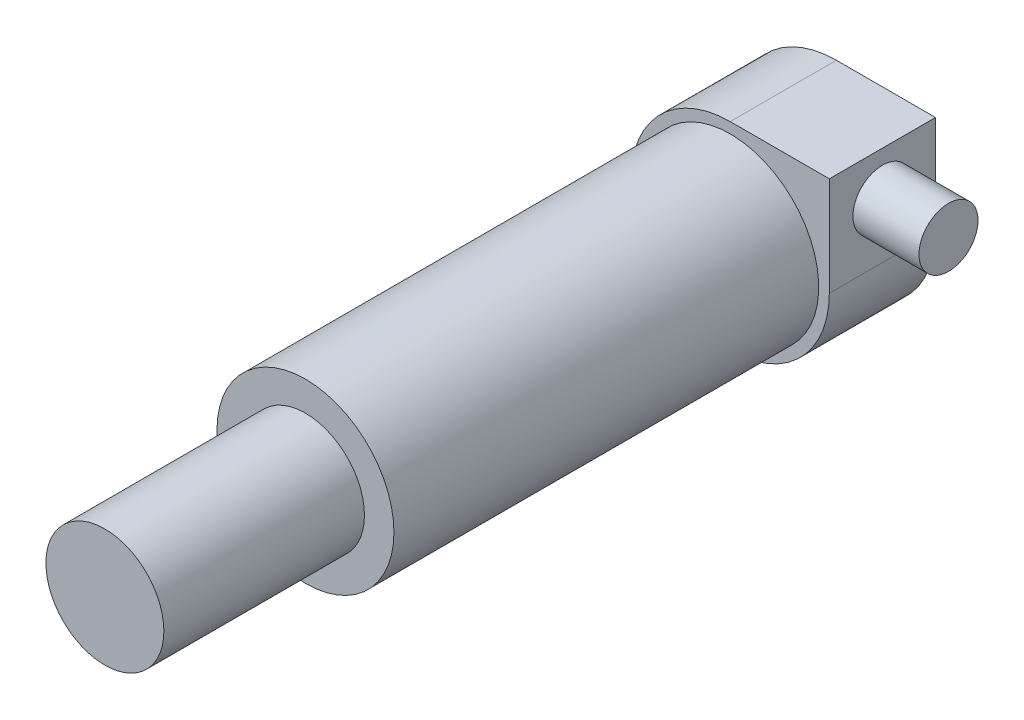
ISO-10303-21;
HEADER;
FILE_DESCRIPTION(('STEP AP214'),'2;1');
FILE_NAME('part.step','',(''),(''),'','','');
FILE_SCHEMA(('AUTOMOTIVE_DESIGN { 1 0 10303 214 1 1 1 1 }'));
ENDSEC;
DATA;
#1=APPLICATION_CONTEXT('core data for automotive mechanical design processes');
#2=APPLICATION_PROTOCOL_DEFINITION('international standard','automotive_design',2000,#1);
#3=PRODUCT_CONTEXT('',#1,'mechanical');
#4=PRODUCT('Part','Part','',(#3));
#5=PRODUCT_RELATED_PRODUCT_CATEGORY('part','',(#4));
#6=PRODUCT_DEFINITION_FORMATION('','',#4);
#7=PRODUCT_DEFINITION_CONTEXT('part definition',#1,'design');
#8=PRODUCT_DEFINITION('design','',#6,#7);
#9=PRODUCT_DEFINITION_SHAPE('','',#8);
#10=(LENGTH_UNIT() NAMED_UNIT(*) SI_UNIT(.MILLI.,.METRE.));
#11=(NAMED_UNIT(*) PLANE_ANGLE_UNIT() SI_UNIT($,.RADIAN.));
#12=(NAMED_UNIT(*) SI_UNIT($,.STERADIAN.) SOLID_ANGLE_UNIT());
#13=UNCERTAINTY_MEASURE_WITH_UNIT(LENGTH_MEASURE(1.E-05),#10,'distance_accuracy_value','');
#14=(GEOMETRIC_REPRESENTATION_CONTEXT(3) GLOBAL_UNCERTAINTY_ASSIGNED_CONTEXT((#13)) GLOBAL_UNIT_ASSIGNED_CONTEXT((#10,
#11,#12)) REPRESENTATION_CONTEXT('',''));
#15=CARTESIAN_POINT('',(0.,0.,0.));
#16=DIRECTION('',(0.,0.,1.));
#17=DIRECTION('',(1.,0.,0.));
#18=AXIS2_PLACEMENT_3D('',#15,#16,#17);
#19=CARTESIAN_POINT('',(0.,0.,91.44));
#20=DIRECTION('',(0.,0.,1.));
#21=DIRECTION('',(1.,0.,0.));
#22=AXIS2_PLACEMENT_3D('',#19,#20,#21);
#23=PLANE('',#22);
#24=CARTESIAN_POINT('',(0.,0.,91.44));
#25=DIRECTION('',(0.,0.,1.));
#26=DIRECTION('',(1.,0.,0.));
#27=AXIS2_PLACEMENT_3D('',#24,#25,#26);
#28=CIRCLE('',#27,19.05);
#29=CARTESIAN_POINT('',(19.05,0.,91.44));
#30=VERTEX_POINT('',#29);
#31=EDGE_CURVE('E36',#30,#30,#28,.T.);
#32=ORIENTED_EDGE('',*,*,#31,.T.);
#33=EDGE_LOOP('',(#32));
#34=FACE_BOUND('',#33,.T.);
#35=CARTESIAN_POINT('',(0.,0.,91.44));
#36=DIRECTION('',(0.,0.,1.));
#37=DIRECTION('',(1.,0.,0.));
#38=AXIS2_PLACEMENT_3D('',#35,#36,#37);
#39=CIRCLE('',#38,12.7);
#40=CARTESIAN_POINT('',(12.7,0.,91.44));
#41=VERTEX_POINT('',#40);
#42=EDGE_CURVE('E162',#41,#41,#39,.T.);
#43=ORIENTED_EDGE('',*,*,#42,.F.);
#44=EDGE_LOOP('',(#43));
#45=FACE_BOUND('',#44,.T.);
#46=ADVANCED_FACE('F28',(#34,#45),#23,.T.);
#47=CARTESIAN_POINT('',(0.,0.,-22.86));
#48=DIRECTION('',(0.,0.,-1.));
#49=DIRECTION('',(-1.,0.,0.));
#50=AXIS2_PLACEMENT_3D('',#47,#48,#49);
#51=PLANE('',#50);
#52=CARTESIAN_POINT('',(0.,0.,-22.86));
#53=DIRECTION('',(0.,0.,-1.));
#54=DIRECTION('',(-1.,0.,0.));
#55=AXIS2_PLACEMENT_3D('',#52,#53,#54);
#56=CIRCLE('',#55,21.336);
#57=CARTESIAN_POINT('',(21.336,0.,-22.86));
#58=VERTEX_POINT('',#57);
#59=CARTESIAN_POINT('',(0.,21.336,-22.86));
#60=VERTEX_POINT('',#59);
#61=EDGE_CURVE('E91',#58,#60,#56,.T.);
#62=ORIENTED_EDGE('',*,*,#61,.T.);
#63=DIRECTION('',(1.,0.,0.));
#64=VECTOR('',#63,1.);
#65=CARTESIAN_POINT('',(0.,21.336,-22.86));
#66=LINE('',#65,#64);
#67=CARTESIAN_POINT('',(21.336,21.336,-22.86));
#68=VERTEX_POINT('',#67);
#69=EDGE_CURVE('E47',#60,#68,#66,.T.);
#70=ORIENTED_EDGE('',*,*,#69,.T.);
#71=DIRECTION('',(0.,-1.,0.));
#72=VECTOR('',#71,1.);
#73=CARTESIAN_POINT('',(21.336,0.,-22.86));
#74=LINE('',#73,#72);
#75=EDGE_CURVE('E43',#68,#58,#74,.T.);
#76=ORIENTED_EDGE('',*,*,#75,.T.);
#77=EDGE_LOOP('',(#62,#70,#76));
#78=FACE_BOUND('',#77,.T.);
#79=CARTESIAN_POINT('',(0.,0.,-22.86));
#80=DIRECTION('',(0.,0.,-1.));
#81=DIRECTION('',(-1.,0.,0.));
#82=AXIS2_PLACEMENT_3D('',#79,#80,#81);
#83=CIRCLE('',#82,6.35);
#84=CARTESIAN_POINT('',(-6.35,0.,-22.86));
#85=VERTEX_POINT('',#84);
#86=EDGE_CURVE('E161',#85,#85,#83,.T.);
#87=ORIENTED_EDGE('',*,*,#86,.F.);
#88=EDGE_LOOP('',(#87));
#89=FACE_BOUND('',#88,.T.);
#90=ADVANCED_FACE('F116',(#78,#89),#51,.T.);
#91=CARTESIAN_POINT('',(21.336,0.,-22.86));
#92=DIRECTION('',(-1.,0.,0.));
#93=DIRECTION('',(0.,0.,1.));
#94=AXIS2_PLACEMENT_3D('',#91,#92,#93);
#95=PLANE('',#94);
#96=DIRECTION('',(0.,-1.,0.));
#97=VECTOR('',#96,1.);
#98=CARTESIAN_POINT('',(21.336,0.,0.));
#99=LINE('',#98,#97);
#100=CARTESIAN_POINT('',(21.336,21.336,0.));
#101=VERTEX_POINT('',#100);
#102=CARTESIAN_POINT('',(21.336,0.,0.));
#103=VERTEX_POINT('',#102);
#104=EDGE_CURVE('E68',#101,#103,#99,.T.);
#105=ORIENTED_EDGE('',*,*,#104,.T.);
#106=DIRECTION('',(0.,0.,1.));
#107=VECTOR('',#106,1.);
#108=CARTESIAN_POINT('',(21.336,0.,-22.86));
#109=LINE('',#108,#107);
#110=EDGE_CURVE('E82',#58,#103,#109,.T.);
#111=ORIENTED_EDGE('',*,*,#110,.F.);
#112=ORIENTED_EDGE('',*,*,#75,.F.);
#113=DIRECTION('',(0.,0.,1.));
#114=VECTOR('',#113,1.);
#115=CARTESIAN_POINT('',(21.336,21.336,-22.86));
#116=LINE('',#115,#114);
#117=EDGE_CURVE('E78',#68,#101,#116,.T.);
#118=ORIENTED_EDGE('',*,*,#117,.T.);
#119=EDGE_LOOP('',(#105,#111,#112,#118));
#120=FACE_BOUND('',#119,.T.);
#121=CARTESIAN_POINT('',(21.336,11.811,-11.43));
#122=DIRECTION('',(-1.,0.,0.));
#123=DIRECTION('',(0.,0.,1.));
#124=AXIS2_PLACEMENT_3D('',#121,#122,#123);
#125=CIRCLE('',#124,6.35);
#126=CARTESIAN_POINT('',(21.336,11.811,-5.08));
#127=VERTEX_POINT('',#126);
#128=EDGE_CURVE('E11',#127,#127,#125,.F.);
#129=ORIENTED_EDGE('',*,*,#128,.F.);
#130=EDGE_LOOP('',(#129));
#131=FACE_BOUND('',#130,.T.);
#132=ADVANCED_FACE('F105',(#120,#131),#95,.F.);
#133=CARTESIAN_POINT('',(0.,0.,91.44));
#134=DIRECTION('',(0.,0.,-1.));
#135=DIRECTION('',(-1.,0.,0.));
#136=AXIS2_PLACEMENT_3D('',#133,#134,#135);
#137=CYLINDRICAL_SURFACE('',#136,19.05);
#138=ORIENTED_EDGE('',*,*,#31,.F.);
#139=EDGE_LOOP('',(#138));
#140=FACE_BOUND('',#139,.T.);
#141=CARTESIAN_POINT('',(0.,0.,0.));
#142=DIRECTION('',(0.,0.,-1.));
#143=DIRECTION('',(-1.,0.,0.));
#144=AXIS2_PLACEMENT_3D('',#141,#142,#143);
#145=CIRCLE('',#144,19.05);
#146=CARTESIAN_POINT('',(-19.05,0.,0.));
#147=VERTEX_POINT('',#146);
#148=EDGE_CURVE('E77',#147,#147,#145,.T.);
#149=ORIENTED_EDGE('',*,*,#148,.F.);
#150=EDGE_LOOP('',(#149));
#151=FACE_BOUND('',#150,.T.);
#152=ADVANCED_FACE('F30',(#140,#151),#137,.T.);
#153=CARTESIAN_POINT('',(0.,0.,0.));
#154=DIRECTION('',(0.,0.,-1.));
#155=DIRECTION('',(-1.,0.,0.));
#156=AXIS2_PLACEMENT_3D('',#153,#154,#155);
#157=PLANE('',#156);
#158=CARTESIAN_POINT('',(0.,0.,0.));
#159=DIRECTION('',(0.,0.,-1.));
#160=DIRECTION('',(-1.,0.,0.));
#161=AXIS2_PLACEMENT_3D('',#158,#159,#160);
#162=CIRCLE('',#161,21.336);
#163=CARTESIAN_POINT('',(0.,21.336,0.));
#164=VERTEX_POINT('',#163);
#165=EDGE_CURVE('E67',#103,#164,#162,.T.);
#166=ORIENTED_EDGE('',*,*,#165,.F.);
#167=ORIENTED_EDGE('',*,*,#104,.F.);
#168=DIRECTION('',(1.,0.,0.));
#169=VECTOR('',#168,1.);
#170=CARTESIAN_POINT('',(0.,21.336,0.));
#171=LINE('',#170,#169);
#172=EDGE_CURVE('E62',#164,#101,#171,.T.);
#173=ORIENTED_EDGE('',*,*,#172,.F.);
#174=EDGE_LOOP('',(#166,#167,#173));
#175=FACE_BOUND('',#174,.T.);
#176=ORIENTED_EDGE('',*,*,#148,.T.);
#177=EDGE_LOOP('',(#176));
#178=FACE_BOUND('',#177,.T.);
#179=ADVANCED_FACE('F64',(#175,#178),#157,.F.);
#180=CARTESIAN_POINT('',(0.,0.,-22.86));
#181=DIRECTION('',(0.,0.,1.));
#182=DIRECTION('',(1.,0.,0.));
#183=AXIS2_PLACEMENT_3D('',#180,#181,#182);
#184=CYLINDRICAL_SURFACE('',#183,21.336);
#185=ORIENTED_EDGE('',*,*,#165,.T.);
#186=DIRECTION('',(0.,0.,1.));
#187=VECTOR('',#186,1.);
#188=CARTESIAN_POINT('',(0.,21.336,-22.86));
#189=LINE('',#188,#187);
#190=EDGE_CURVE('E73',#60,#164,#189,.T.);
#191=ORIENTED_EDGE('',*,*,#190,.F.);
#192=ORIENTED_EDGE('',*,*,#61,.F.);
#193=ORIENTED_EDGE('',*,*,#110,.T.);
#194=EDGE_LOOP('',(#185,#191,#192,#193));
#195=FACE_BOUND('',#194,.T.);
#196=ADVANCED_FACE('F81',(#195),#184,.T.);
#197=CARTESIAN_POINT('',(0.,21.336,-22.86));
#198=DIRECTION('',(0.,-1.,0.));
#199=DIRECTION('',(0.,0.,-1.));
#200=AXIS2_PLACEMENT_3D('',#197,#198,#199);
#201=PLANE('',#200);
#202=ORIENTED_EDGE('',*,*,#172,.T.);
#203=ORIENTED_EDGE('',*,*,#117,.F.);
#204=ORIENTED_EDGE('',*,*,#69,.F.);
#205=ORIENTED_EDGE('',*,*,#190,.T.);
#206=EDGE_LOOP('',(#202,#203,#204,#205));
#207=FACE_BOUND('',#206,.T.);
#208=ADVANCED_FACE('F74',(#207),#201,.F.);
#209=CARTESIAN_POINT('',(35.56,11.811,-11.43));
#210=DIRECTION('',(-1.,0.,0.));
#211=DIRECTION('',(0.,0.,1.));
#212=AXIS2_PLACEMENT_3D('',#209,#210,#211);
#213=CYLINDRICAL_SURFACE('',#212,6.35);
#214=CARTESIAN_POINT('',(35.56,11.811,-11.43));
#215=DIRECTION('',(1.,0.,0.));
#216=DIRECTION('',(0.,0.,-1.));
#217=AXIS2_PLACEMENT_3D('',#214,#215,#216);
#218=CIRCLE('',#217,6.35);
#219=CARTESIAN_POINT('',(35.56,11.811,-17.78));
#220=VERTEX_POINT('',#219);
#221=EDGE_CURVE('E83',#220,#220,#218,.T.);
#222=ORIENTED_EDGE('',*,*,#221,.F.);
#223=EDGE_LOOP('',(#222));
#224=FACE_BOUND('',#223,.T.);
#225=ORIENTED_EDGE('',*,*,#128,.T.);
#226=EDGE_LOOP('',(#225));
#227=FACE_BOUND('',#226,.T.);
#228=ADVANCED_FACE('F123',(#224,#227),#213,.T.);
#229=CARTESIAN_POINT('',(35.56,11.811,-11.43));
#230=DIRECTION('',(1.,0.,0.));
#231=DIRECTION('',(0.,0.,-1.));
#232=AXIS2_PLACEMENT_3D('',#229,#230,#231);
#233=PLANE('',#232);
#234=ORIENTED_EDGE('',*,*,#221,.T.);
#235=EDGE_LOOP('',(#234));
#236=FACE_BOUND('',#235,.T.);
#237=ADVANCED_FACE('F132',(#236),#233,.T.);
#238=CARTESIAN_POINT('',(0.,0.,-37.084));
#239=DIRECTION('',(0.,0.,1.));
#240=DIRECTION('',(1.,0.,0.));
#241=AXIS2_PLACEMENT_3D('',#238,#239,#240);
#242=CYLINDRICAL_SURFACE('',#241,6.35);
#243=CARTESIAN_POINT('',(0.,0.,-37.084));
#244=DIRECTION('',(0.,0.,-1.));
#245=DIRECTION('',(-1.,0.,0.));
#246=AXIS2_PLACEMENT_3D('',#243,#244,#245);
#247=CIRCLE('',#246,6.35);
#248=CARTESIAN_POINT('',(-6.35,0.,-37.084));
#249=VERTEX_POINT('',#248);
#250=EDGE_CURVE('E86',#249,#249,#247,.T.);
#251=ORIENTED_EDGE('',*,*,#250,.F.);
#252=EDGE_LOOP('',(#251));
#253=FACE_BOUND('',#252,.T.);
#254=ORIENTED_EDGE('',*,*,#86,.T.);
#255=EDGE_LOOP('',(#254));
#256=FACE_BOUND('',#255,.T.);
#257=ADVANCED_FACE('F137',(#253,#256),#242,.T.);
#258=CARTESIAN_POINT('',(0.,0.,-37.084));
#259=DIRECTION('',(0.,0.,-1.));
#260=DIRECTION('',(-1.,0.,0.));
#261=AXIS2_PLACEMENT_3D('',#258,#259,#260);
#262=PLANE('',#261);
#263=ORIENTED_EDGE('',*,*,#250,.T.);
#264=EDGE_LOOP('',(#263));
#265=FACE_BOUND('',#264,.T.);
#266=ADVANCED_FACE('F144',(#265),#262,.T.);
#267=CARTESIAN_POINT('',(0.,0.,134.62));
#268=DIRECTION('',(0.,0.,-1.));
#269=DIRECTION('',(-1.,0.,0.));
#270=AXIS2_PLACEMENT_3D('',#267,#268,#269);
#271=CYLINDRICAL_SURFACE('',#270,12.7);
#272=CARTESIAN_POINT('',(0.,0.,134.62));
#273=DIRECTION('',(0.,0.,1.));
#274=DIRECTION('',(1.,0.,0.));
#275=AXIS2_PLACEMENT_3D('',#272,#273,#274);
#276=CIRCLE('',#275,12.7);
#277=CARTESIAN_POINT('',(12.7,0.,134.62));
#278=VERTEX_POINT('',#277);
#279=EDGE_CURVE('E160',#278,#278,#276,.T.);
#280=ORIENTED_EDGE('',*,*,#279,.F.);
#281=EDGE_LOOP('',(#280));
#282=FACE_BOUND('',#281,.T.);
#283=ORIENTED_EDGE('',*,*,#42,.T.);
#284=EDGE_LOOP('',(#283));
#285=FACE_BOUND('',#284,.T.);
#286=ADVANCED_FACE('F148',(#282,#285),#271,.T.);
#287=CARTESIAN_POINT('',(0.,0.,134.62));
#288=DIRECTION('',(0.,0.,1.));
#289=DIRECTION('',(1.,0.,0.));
#290=AXIS2_PLACEMENT_3D('',#287,#288,#289);
#291=PLANE('',#290);
#292=ORIENTED_EDGE('',*,*,#279,.T.);
#293=EDGE_LOOP('',(#292));
#294=FACE_BOUND('',#293,.T.);
#295=ADVANCED_FACE('F152',(#294),#291,.T.);
#296=CLOSED_SHELL('',(#46,#90,#132,#152,#179,#196,#208,#228,#237,#257,#266,#286,#295));
#297=MANIFOLD_SOLID_BREP('B2',#296);
#298=ADVANCED_BREP_SHAPE_REPRESENTATION('',(#18,#297),#14);
#299=SHAPE_DEFINITION_REPRESENTATION(#9,#298);
ENDSEC;
END-ISO-10303-21;
